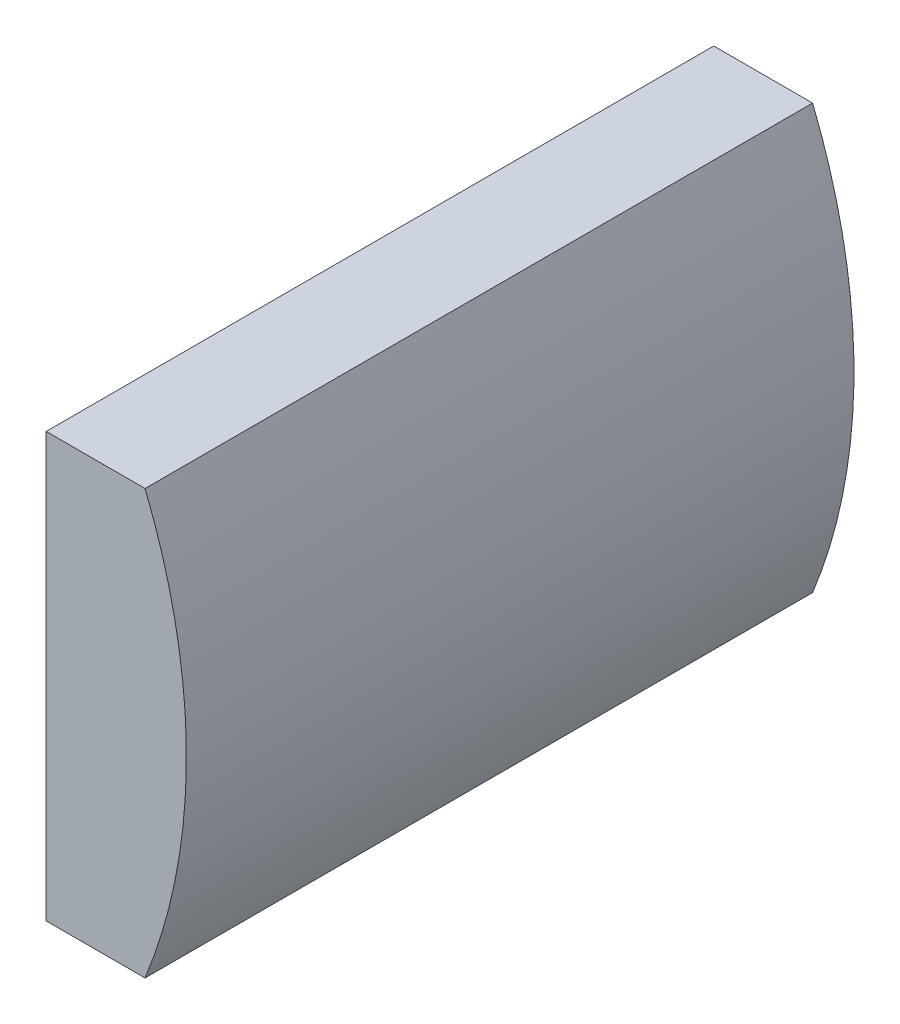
ISO-10303-21;
HEADER;
FILE_DESCRIPTION(('STEP AP214'),'2;1');
FILE_NAME('part.step','',(''),(''),'','','');
FILE_SCHEMA(('AUTOMOTIVE_DESIGN { 1 0 10303 214 1 1 1 1 }'));
ENDSEC;
DATA;
#1=APPLICATION_CONTEXT('core data for automotive mechanical design processes');
#2=APPLICATION_PROTOCOL_DEFINITION('international standard','automotive_design',2000,#1);
#3=PRODUCT_CONTEXT('',#1,'mechanical');
#4=PRODUCT('Part','Part','',(#3));
#5=PRODUCT_RELATED_PRODUCT_CATEGORY('part','',(#4));
#6=PRODUCT_DEFINITION_FORMATION('','',#4);
#7=PRODUCT_DEFINITION_CONTEXT('part definition',#1,'design');
#8=PRODUCT_DEFINITION('design','',#6,#7);
#9=PRODUCT_DEFINITION_SHAPE('','',#8);
#10=(LENGTH_UNIT() NAMED_UNIT(*) SI_UNIT(.MILLI.,.METRE.));
#11=(NAMED_UNIT(*) PLANE_ANGLE_UNIT() SI_UNIT($,.RADIAN.));
#12=(NAMED_UNIT(*) SI_UNIT($,.STERADIAN.) SOLID_ANGLE_UNIT());
#13=UNCERTAINTY_MEASURE_WITH_UNIT(LENGTH_MEASURE(1.E-05),#10,'distance_accuracy_value','');
#14=(GEOMETRIC_REPRESENTATION_CONTEXT(3) GLOBAL_UNCERTAINTY_ASSIGNED_CONTEXT((#13)) GLOBAL_UNIT_ASSIGNED_CONTEXT((#10,
#11,#12)) REPRESENTATION_CONTEXT('',''));
#15=CARTESIAN_POINT('',(0.,0.,0.));
#16=DIRECTION('',(0.,0.,1.));
#17=DIRECTION('',(1.,0.,0.));
#18=AXIS2_PLACEMENT_3D('',#15,#16,#17);
#19=CARTESIAN_POINT('',(6.35,-3.175,10.));
#20=DIRECTION('',(-1.,0.,0.));
#21=DIRECTION('',(0.,0.,1.));
#22=AXIS2_PLACEMENT_3D('',#19,#20,#21);
#23=PLANE('',#22);
#24=DIRECTION('',(0.,1.,0.));
#25=VECTOR('',#24,1.);
#26=CARTESIAN_POINT('',(6.35,0.,10.));
#27=LINE('',#26,#25);
#28=CARTESIAN_POINT('',(6.35,3.175,10.));
#29=VERTEX_POINT('',#28);
#30=CARTESIAN_POINT('',(6.35,-3.175,10.));
#31=VERTEX_POINT('',#30);
#32=EDGE_CURVE('E70',#29,#31,#27,.F.);
#33=ORIENTED_EDGE('',*,*,#32,.F.);
#34=DIRECTION('',(0.,0.,1.));
#35=VECTOR('',#34,1.);
#36=CARTESIAN_POINT('',(6.35,3.175,10.));
#37=LINE('',#36,#35);
#38=CARTESIAN_POINT('',(6.35,3.175,0.));
#39=VERTEX_POINT('',#38);
#40=EDGE_CURVE('E69',#39,#29,#37,.T.);
#41=ORIENTED_EDGE('',*,*,#40,.F.);
#42=DIRECTION('',(0.,1.,0.));
#43=VECTOR('',#42,1.);
#44=CARTESIAN_POINT('',(6.35,0.,0.));
#45=LINE('',#44,#43);
#46=CARTESIAN_POINT('',(6.35,-3.175,0.));
#47=VERTEX_POINT('',#46);
#48=EDGE_CURVE('E60',#39,#47,#45,.F.);
#49=ORIENTED_EDGE('',*,*,#48,.T.);
#50=DIRECTION('',(0.,0.,1.));
#51=VECTOR('',#50,1.);
#52=CARTESIAN_POINT('',(6.35,-3.175,10.));
#53=LINE('',#52,#51);
#54=EDGE_CURVE('E54',#47,#31,#53,.T.);
#55=ORIENTED_EDGE('',*,*,#54,.T.);
#56=EDGE_LOOP('',(#33,#41,#49,#55));
#57=FACE_BOUND('',#56,.T.);
#58=ADVANCED_FACE('F16',(#57),#23,.T.);
#59=CARTESIAN_POINT('',(0.,0.,0.));
#60=DIRECTION('',(0.,0.,1.));
#61=DIRECTION('',(1.,0.,0.));
#62=AXIS2_PLACEMENT_3D('',#59,#60,#61);
#63=PLANE('',#62);
#64=DIRECTION('',(1.,0.,0.));
#65=VECTOR('',#64,1.);
#66=CARTESIAN_POINT('',(6.35,3.175,0.));
#67=LINE('',#66,#65);
#68=CARTESIAN_POINT('',(7.83082850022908,3.175,0.));
#69=VERTEX_POINT('',#68);
#70=EDGE_CURVE('E64',#69,#39,#67,.F.);
#71=ORIENTED_EDGE('',*,*,#70,.F.);
#72=CARTESIAN_POINT('',(0.,0.,0.));
#73=DIRECTION('',(0.,0.,-1.));
#74=DIRECTION('',(-1.,0.,0.));
#75=AXIS2_PLACEMENT_3D('',#72,#73,#74);
#76=CIRCLE('',#75,8.45);
#77=CARTESIAN_POINT('',(7.83082850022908,-3.175,0.));
#78=VERTEX_POINT('',#77);
#79=EDGE_CURVE('E19',#78,#69,#76,.F.);
#80=ORIENTED_EDGE('',*,*,#79,.F.);
#81=DIRECTION('',(1.,0.,0.));
#82=VECTOR('',#81,1.);
#83=CARTESIAN_POINT('',(6.35,-3.175,0.));
#84=LINE('',#83,#82);
#85=EDGE_CURVE('E66',#78,#47,#84,.F.);
#86=ORIENTED_EDGE('',*,*,#85,.T.);
#87=ORIENTED_EDGE('',*,*,#48,.F.);
#88=EDGE_LOOP('',(#71,#80,#86,#87));
#89=FACE_BOUND('',#88,.T.);
#90=ADVANCED_FACE('F62',(#89),#63,.F.);
#91=CARTESIAN_POINT('',(6.35,3.175,10.));
#92=DIRECTION('',(0.,1.,0.));
#93=DIRECTION('',(0.,0.,1.));
#94=AXIS2_PLACEMENT_3D('',#91,#92,#93);
#95=PLANE('',#94);
#96=DIRECTION('',(1.,0.,0.));
#97=VECTOR('',#96,1.);
#98=CARTESIAN_POINT('',(0.,3.175,10.));
#99=LINE('',#98,#97);
#100=CARTESIAN_POINT('',(7.83082850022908,3.175,10.));
#101=VERTEX_POINT('',#100);
#102=EDGE_CURVE('E90',#101,#29,#99,.F.);
#103=ORIENTED_EDGE('',*,*,#102,.F.);
#104=DIRECTION('',(0.,0.,-1.));
#105=VECTOR('',#104,1.);
#106=CARTESIAN_POINT('',(7.83082850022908,3.175,10.));
#107=LINE('',#106,#105);
#108=EDGE_CURVE('E76',#69,#101,#107,.F.);
#109=ORIENTED_EDGE('',*,*,#108,.F.);
#110=ORIENTED_EDGE('',*,*,#70,.T.);
#111=ORIENTED_EDGE('',*,*,#40,.T.);
#112=EDGE_LOOP('',(#103,#109,#110,#111));
#113=FACE_BOUND('',#112,.T.);
#114=ADVANCED_FACE('F74',(#113),#95,.T.);
#115=CARTESIAN_POINT('',(0.,0.,10.));
#116=DIRECTION('',(0.,0.,1.));
#117=DIRECTION('',(1.,0.,0.));
#118=AXIS2_PLACEMENT_3D('',#115,#116,#117);
#119=PLANE('',#118);
#120=CARTESIAN_POINT('',(0.,0.,10.));
#121=DIRECTION('',(0.,0.,-1.));
#122=DIRECTION('',(-1.,0.,0.));
#123=AXIS2_PLACEMENT_3D('',#120,#121,#122);
#124=CIRCLE('',#123,8.45);
#125=CARTESIAN_POINT('',(7.83082850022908,-3.175,10.));
#126=VERTEX_POINT('',#125);
#127=EDGE_CURVE('E25',#101,#126,#124,.T.);
#128=ORIENTED_EDGE('',*,*,#127,.F.);
#129=ORIENTED_EDGE('',*,*,#102,.T.);
#130=ORIENTED_EDGE('',*,*,#32,.T.);
#131=DIRECTION('',(1.,0.,0.));
#132=VECTOR('',#131,1.);
#133=CARTESIAN_POINT('',(6.35,-3.175,10.));
#134=LINE('',#133,#132);
#135=EDGE_CURVE('E34',#31,#126,#134,.T.);
#136=ORIENTED_EDGE('',*,*,#135,.T.);
#137=EDGE_LOOP('',(#128,#129,#130,#136));
#138=FACE_BOUND('',#137,.T.);
#139=ADVANCED_FACE('F103',(#138),#119,.T.);
#140=CARTESIAN_POINT('',(6.35,-3.175,10.));
#141=DIRECTION('',(0.,1.,0.));
#142=DIRECTION('',(0.,0.,1.));
#143=AXIS2_PLACEMENT_3D('',#140,#141,#142);
#144=PLANE('',#143);
#145=DIRECTION('',(0.,0.,-1.));
#146=VECTOR('',#145,1.);
#147=CARTESIAN_POINT('',(7.83082850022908,-3.175,10.));
#148=LINE('',#147,#146);
#149=EDGE_CURVE('E11',#126,#78,#148,.T.);
#150=ORIENTED_EDGE('',*,*,#149,.F.);
#151=ORIENTED_EDGE('',*,*,#135,.F.);
#152=ORIENTED_EDGE('',*,*,#54,.F.);
#153=ORIENTED_EDGE('',*,*,#85,.F.);
#154=EDGE_LOOP('',(#150,#151,#152,#153));
#155=FACE_BOUND('',#154,.T.);
#156=ADVANCED_FACE('F105',(#155),#144,.F.);
#157=CARTESIAN_POINT('',(0.,0.,10.));
#158=DIRECTION('',(0.,0.,-1.));
#159=DIRECTION('',(-1.,0.,0.));
#160=AXIS2_PLACEMENT_3D('',#157,#158,#159);
#161=CYLINDRICAL_SURFACE('',#160,8.45);
#162=ORIENTED_EDGE('',*,*,#127,.T.);
#163=ORIENTED_EDGE('',*,*,#149,.T.);
#164=ORIENTED_EDGE('',*,*,#79,.T.);
#165=ORIENTED_EDGE('',*,*,#108,.T.);
#166=EDGE_LOOP('',(#162,#163,#164,#165));
#167=FACE_BOUND('',#166,.T.);
#168=ADVANCED_FACE('F106',(#167),#161,.T.);
#169=CLOSED_SHELL('',(#58,#90,#114,#139,#156,#168));
#170=MANIFOLD_SOLID_BREP('B1',#169);
#171=ADVANCED_BREP_SHAPE_REPRESENTATION('',(#18,#170),#14);
#172=SHAPE_DEFINITION_REPRESENTATION(#9,#171);
ENDSEC;
END-ISO-10303-21;
